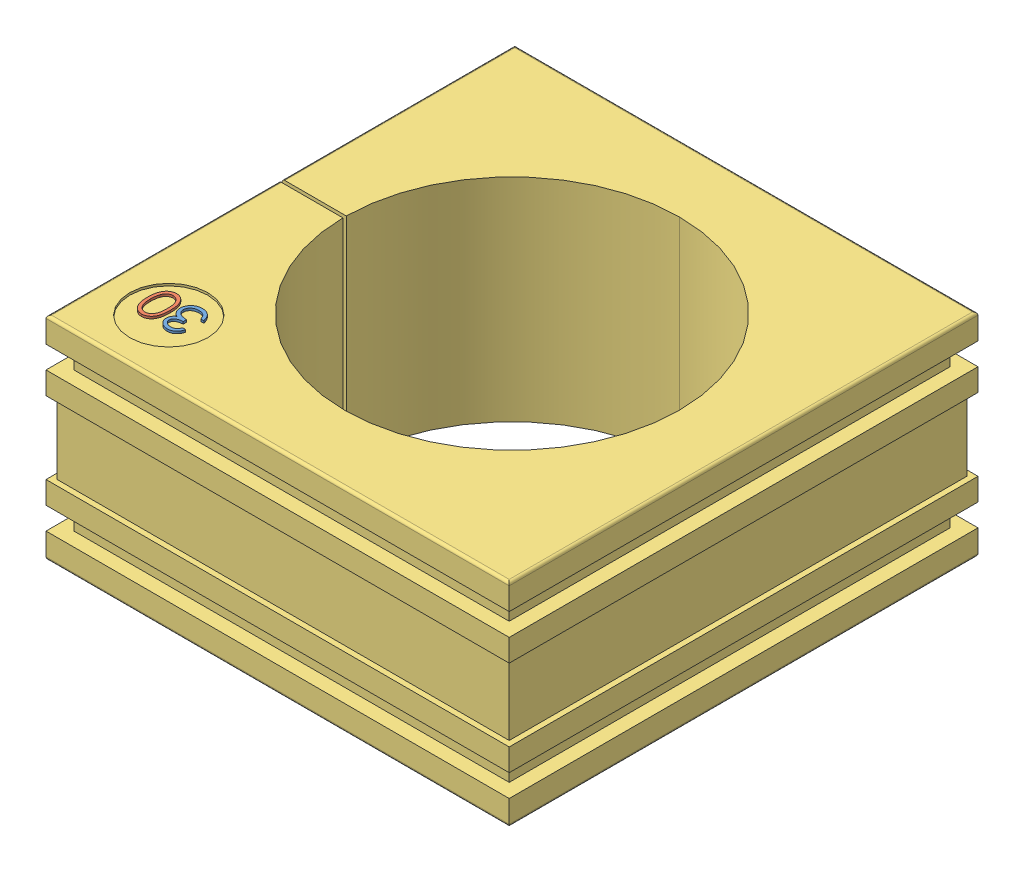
SolidWorks assembly 70130.SLDASM, configuration Default (file format 8000). Lengths in mm.
Overall size (41.5 19.2 42).
3 component instances, 3 part files, 0 mates.
Components (placement in the parent):
- 70130_01-1: 70130_01.SLDPRT [Default] at origin size (2.04 0.2 3.15)
- 70130_02-1: 70130_02.SLDPRT [Default] at origin size (2.04 0.2 3.15)
- 70130_03-1: 70130_03.SLDPRT [Default] at origin size (41.5 19 42)
